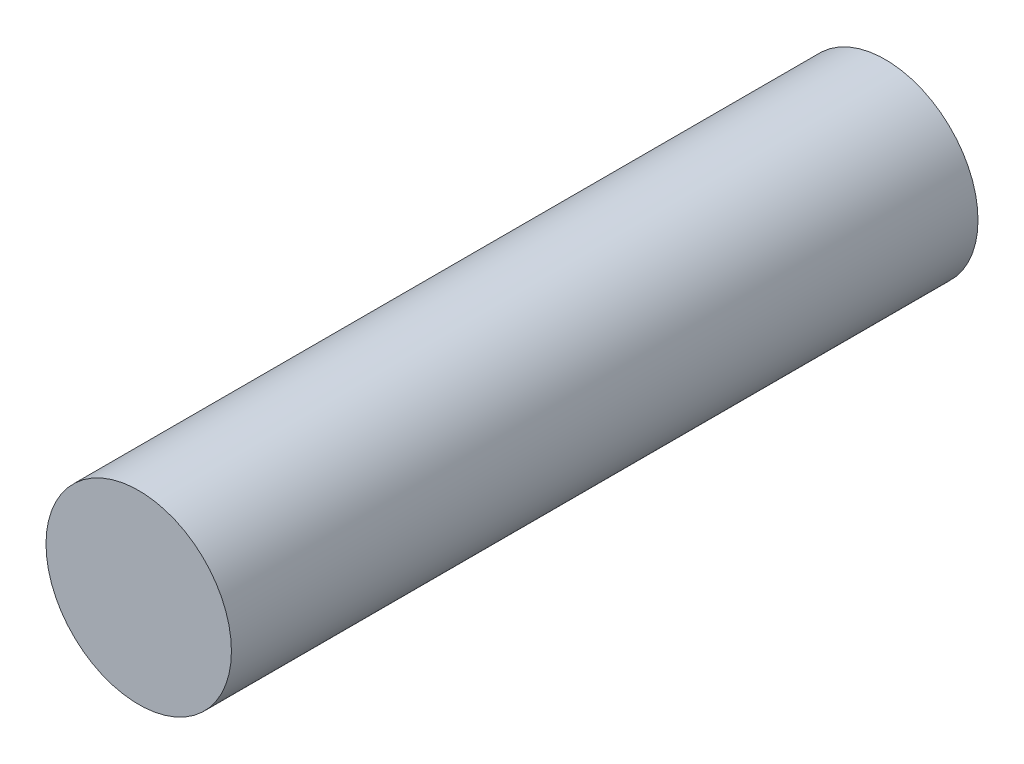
from build123d import *

# Parameters (mm, degrees)
SKETCH1_R           = 38
BOSS_EXTRUDE1_DEPTH = 153


with BuildPart() as part:
    # Sketch1 → Boss-Extrude1 (new, symmetric)
    with BuildSketch(Plane.XY):
        Circle(SKETCH1_R)
    extrude(amount=BOSS_EXTRUDE1_DEPTH, both=True)


solid = part.part
